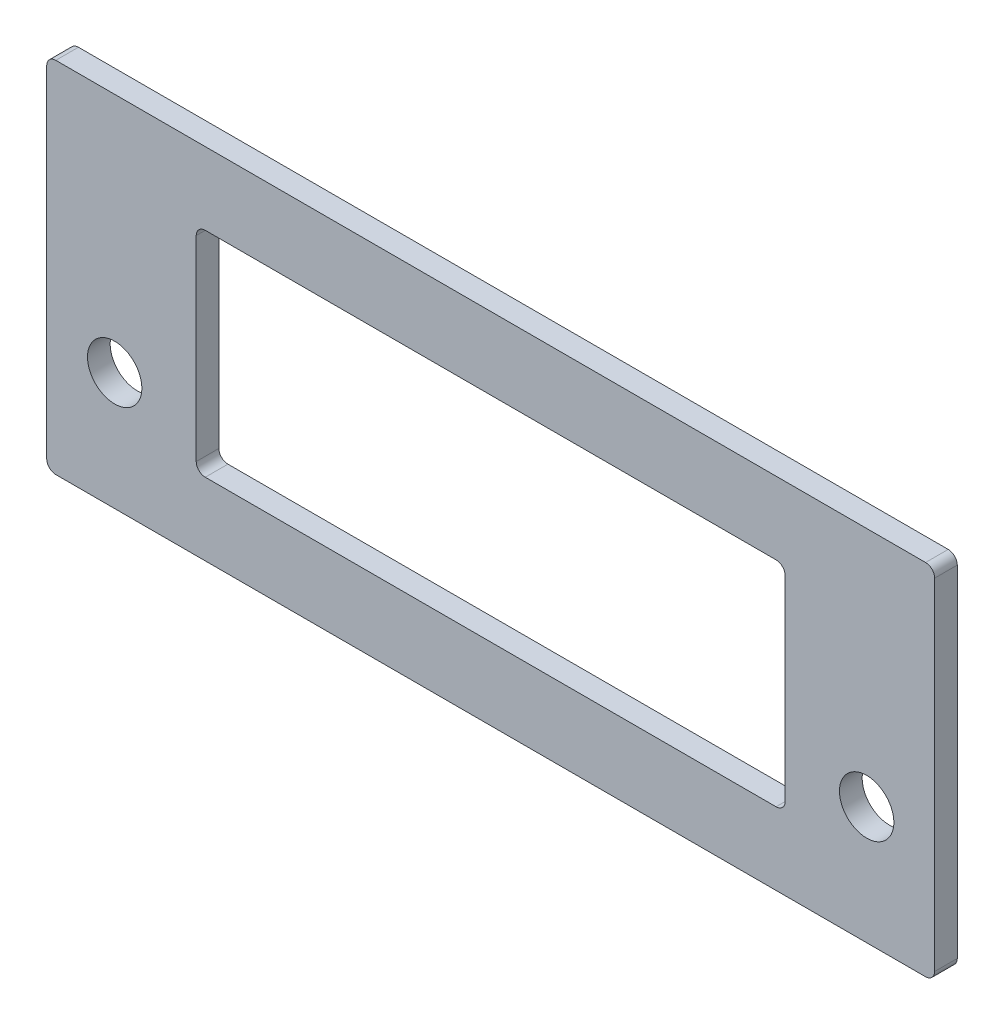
ISO-10303-21;
HEADER;
FILE_DESCRIPTION(('STEP AP214'),'2;1');
FILE_NAME('part.step','',(''),(''),'','','');
FILE_SCHEMA(('AUTOMOTIVE_DESIGN { 1 0 10303 214 1 1 1 1 }'));
ENDSEC;
DATA;
#1=APPLICATION_CONTEXT('core data for automotive mechanical design processes');
#2=APPLICATION_PROTOCOL_DEFINITION('international standard','automotive_design',2000,#1);
#3=PRODUCT_CONTEXT('',#1,'mechanical');
#4=PRODUCT('Part','Part','',(#3));
#5=PRODUCT_RELATED_PRODUCT_CATEGORY('part','',(#4));
#6=PRODUCT_DEFINITION_FORMATION('','',#4);
#7=PRODUCT_DEFINITION_CONTEXT('part definition',#1,'design');
#8=PRODUCT_DEFINITION('design','',#6,#7);
#9=PRODUCT_DEFINITION_SHAPE('','',#8);
#10=(LENGTH_UNIT() NAMED_UNIT(*) SI_UNIT(.MILLI.,.METRE.));
#11=(NAMED_UNIT(*) PLANE_ANGLE_UNIT() SI_UNIT($,.RADIAN.));
#12=(NAMED_UNIT(*) SI_UNIT($,.STERADIAN.) SOLID_ANGLE_UNIT());
#13=UNCERTAINTY_MEASURE_WITH_UNIT(LENGTH_MEASURE(1.E-05),#10,'distance_accuracy_value','');
#14=(GEOMETRIC_REPRESENTATION_CONTEXT(3) GLOBAL_UNCERTAINTY_ASSIGNED_CONTEXT((#13)) GLOBAL_UNIT_ASSIGNED_CONTEXT((#10,
#11,#12)) REPRESENTATION_CONTEXT('',''));
#15=CARTESIAN_POINT('',(0.,0.,0.));
#16=DIRECTION('',(0.,0.,1.));
#17=DIRECTION('',(1.,0.,0.));
#18=AXIS2_PLACEMENT_3D('',#15,#16,#17);
#19=CARTESIAN_POINT('',(48.,38.6,0.));
#20=DIRECTION('',(0.,0.,-1.));
#21=DIRECTION('',(-1.,0.,0.));
#22=AXIS2_PLACEMENT_3D('',#19,#20,#21);
#23=CYLINDRICAL_SURFACE('',#22,1.);
#24=CARTESIAN_POINT('',(48.,38.6,0.));
#25=DIRECTION('',(0.,0.,1.));
#26=DIRECTION('',(-1.,0.,0.));
#27=AXIS2_PLACEMENT_3D('',#24,#25,#26);
#28=CIRCLE('',#27,1.);
#29=CARTESIAN_POINT('',(49.,38.6,0.));
#30=VERTEX_POINT('',#29);
#31=CARTESIAN_POINT('',(48.,39.6,0.));
#32=VERTEX_POINT('',#31);
#33=EDGE_CURVE('E216',#30,#32,#28,.T.);
#34=ORIENTED_EDGE('',*,*,#33,.F.);
#35=DIRECTION('',(0.,0.,1.));
#36=VECTOR('',#35,1.);
#37=CARTESIAN_POINT('',(49.,38.6,0.));
#38=LINE('',#37,#36);
#39=CARTESIAN_POINT('',(49.,38.6,-2.5));
#40=VERTEX_POINT('',#39);
#41=EDGE_CURVE('E253',#40,#30,#38,.T.);
#42=ORIENTED_EDGE('',*,*,#41,.F.);
#43=CARTESIAN_POINT('',(48.,38.6,-2.5));
#44=DIRECTION('',(0.,0.,-1.));
#45=DIRECTION('',(-1.,0.,0.));
#46=AXIS2_PLACEMENT_3D('',#43,#44,#45);
#47=CIRCLE('',#46,1.);
#48=CARTESIAN_POINT('',(48.,39.6,-2.5));
#49=VERTEX_POINT('',#48);
#50=EDGE_CURVE('E298',#49,#40,#47,.T.);
#51=ORIENTED_EDGE('',*,*,#50,.F.);
#52=DIRECTION('',(0.,0.,-1.));
#53=VECTOR('',#52,1.);
#54=CARTESIAN_POINT('',(48.,39.6,0.));
#55=LINE('',#54,#53);
#56=EDGE_CURVE('E252',#32,#49,#55,.T.);
#57=ORIENTED_EDGE('',*,*,#56,.F.);
#58=EDGE_LOOP('',(#34,#42,#51,#57));
#59=FACE_BOUND('',#58,.T.);
#60=ADVANCED_FACE('F15',(#59),#23,.T.);
#61=CARTESIAN_POINT('',(48.,1.,0.));
#62=DIRECTION('',(0.,0.,-1.));
#63=DIRECTION('',(-1.,0.,0.));
#64=AXIS2_PLACEMENT_3D('',#61,#62,#63);
#65=CYLINDRICAL_SURFACE('',#64,1.);
#66=CARTESIAN_POINT('',(48.,1.,0.));
#67=DIRECTION('',(0.,0.,1.));
#68=DIRECTION('',(-1.,0.,0.));
#69=AXIS2_PLACEMENT_3D('',#66,#67,#68);
#70=CIRCLE('',#69,1.);
#71=CARTESIAN_POINT('',(48.,0.,0.));
#72=VERTEX_POINT('',#71);
#73=CARTESIAN_POINT('',(49.,1.,0.));
#74=VERTEX_POINT('',#73);
#75=EDGE_CURVE('E205',#72,#74,#70,.T.);
#76=ORIENTED_EDGE('',*,*,#75,.F.);
#77=DIRECTION('',(0.,0.,1.));
#78=VECTOR('',#77,1.);
#79=CARTESIAN_POINT('',(48.,0.,0.));
#80=LINE('',#79,#78);
#81=CARTESIAN_POINT('',(48.,0.,-2.5));
#82=VERTEX_POINT('',#81);
#83=EDGE_CURVE('E342',#82,#72,#80,.T.);
#84=ORIENTED_EDGE('',*,*,#83,.F.);
#85=CARTESIAN_POINT('',(48.,1.,-2.5));
#86=DIRECTION('',(0.,0.,-1.));
#87=DIRECTION('',(-1.,0.,0.));
#88=AXIS2_PLACEMENT_3D('',#85,#86,#87);
#89=CIRCLE('',#88,1.);
#90=CARTESIAN_POINT('',(49.,1.,-2.5));
#91=VERTEX_POINT('',#90);
#92=EDGE_CURVE('E306',#91,#82,#89,.T.);
#93=ORIENTED_EDGE('',*,*,#92,.F.);
#94=DIRECTION('',(0.,0.,-1.));
#95=VECTOR('',#94,1.);
#96=CARTESIAN_POINT('',(49.,1.,0.));
#97=LINE('',#96,#95);
#98=EDGE_CURVE('E346',#74,#91,#97,.T.);
#99=ORIENTED_EDGE('',*,*,#98,.F.);
#100=EDGE_LOOP('',(#76,#84,#93,#99));
#101=FACE_BOUND('',#100,.T.);
#102=ADVANCED_FACE('F414',(#101),#65,.T.);
#103=CARTESIAN_POINT('',(-48.,1.,0.));
#104=DIRECTION('',(0.,0.,-1.));
#105=DIRECTION('',(-1.,0.,0.));
#106=AXIS2_PLACEMENT_3D('',#103,#104,#105);
#107=CYLINDRICAL_SURFACE('',#106,1.);
#108=CARTESIAN_POINT('',(-48.,1.,0.));
#109=DIRECTION('',(0.,0.,1.));
#110=DIRECTION('',(-1.,0.,0.));
#111=AXIS2_PLACEMENT_3D('',#108,#109,#110);
#112=CIRCLE('',#111,1.);
#113=CARTESIAN_POINT('',(-49.,1.,0.));
#114=VERTEX_POINT('',#113);
#115=CARTESIAN_POINT('',(-48.,0.,0.));
#116=VERTEX_POINT('',#115);
#117=EDGE_CURVE('E220',#114,#116,#112,.T.);
#118=ORIENTED_EDGE('',*,*,#117,.F.);
#119=DIRECTION('',(0.,0.,1.));
#120=VECTOR('',#119,1.);
#121=CARTESIAN_POINT('',(-49.,1.,0.));
#122=LINE('',#121,#120);
#123=CARTESIAN_POINT('',(-49.,1.,-2.5));
#124=VERTEX_POINT('',#123);
#125=EDGE_CURVE('E336',#124,#114,#122,.T.);
#126=ORIENTED_EDGE('',*,*,#125,.F.);
#127=CARTESIAN_POINT('',(-48.,1.,-2.5));
#128=DIRECTION('',(0.,0.,-1.));
#129=DIRECTION('',(-1.,0.,0.));
#130=AXIS2_PLACEMENT_3D('',#127,#128,#129);
#131=CIRCLE('',#130,1.);
#132=CARTESIAN_POINT('',(-48.,0.,-2.5));
#133=VERTEX_POINT('',#132);
#134=EDGE_CURVE('E314',#133,#124,#131,.T.);
#135=ORIENTED_EDGE('',*,*,#134,.F.);
#136=DIRECTION('',(0.,0.,-1.));
#137=VECTOR('',#136,1.);
#138=CARTESIAN_POINT('',(-48.,0.,0.));
#139=LINE('',#138,#137);
#140=EDGE_CURVE('E339',#116,#133,#139,.T.);
#141=ORIENTED_EDGE('',*,*,#140,.F.);
#142=EDGE_LOOP('',(#118,#126,#135,#141));
#143=FACE_BOUND('',#142,.T.);
#144=ADVANCED_FACE('F430',(#143),#107,.T.);
#145=CARTESIAN_POINT('',(-48.,38.6,0.));
#146=DIRECTION('',(0.,0.,-1.));
#147=DIRECTION('',(-1.,0.,0.));
#148=AXIS2_PLACEMENT_3D('',#145,#146,#147);
#149=CYLINDRICAL_SURFACE('',#148,1.);
#150=CARTESIAN_POINT('',(-48.,38.6,0.));
#151=DIRECTION('',(0.,0.,1.));
#152=DIRECTION('',(-1.,0.,0.));
#153=AXIS2_PLACEMENT_3D('',#150,#151,#152);
#154=CIRCLE('',#153,1.);
#155=CARTESIAN_POINT('',(-48.,39.6,0.));
#156=VERTEX_POINT('',#155);
#157=CARTESIAN_POINT('',(-49.,38.6,0.));
#158=VERTEX_POINT('',#157);
#159=EDGE_CURVE('E207',#156,#158,#154,.T.);
#160=ORIENTED_EDGE('',*,*,#159,.F.);
#161=DIRECTION('',(0.,0.,1.));
#162=VECTOR('',#161,1.);
#163=CARTESIAN_POINT('',(-48.,39.6,0.));
#164=LINE('',#163,#162);
#165=CARTESIAN_POINT('',(-48.,39.6,-2.5));
#166=VERTEX_POINT('',#165);
#167=EDGE_CURVE('E248',#166,#156,#164,.T.);
#168=ORIENTED_EDGE('',*,*,#167,.F.);
#169=CARTESIAN_POINT('',(-48.,38.6,-2.5));
#170=DIRECTION('',(0.,0.,-1.));
#171=DIRECTION('',(-1.,0.,0.));
#172=AXIS2_PLACEMENT_3D('',#169,#170,#171);
#173=CIRCLE('',#172,1.);
#174=CARTESIAN_POINT('',(-49.,38.6,-2.5));
#175=VERTEX_POINT('',#174);
#176=EDGE_CURVE('E288',#175,#166,#173,.T.);
#177=ORIENTED_EDGE('',*,*,#176,.F.);
#178=DIRECTION('',(0.,0.,-1.));
#179=VECTOR('',#178,1.);
#180=CARTESIAN_POINT('',(-49.,38.6,0.));
#181=LINE('',#180,#179);
#182=EDGE_CURVE('E333',#158,#175,#181,.T.);
#183=ORIENTED_EDGE('',*,*,#182,.F.);
#184=EDGE_LOOP('',(#160,#168,#177,#183));
#185=FACE_BOUND('',#184,.T.);
#186=ADVANCED_FACE('F423',(#185),#149,.T.);
#187=CARTESIAN_POINT('',(-31.5,9.,69.1517172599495));
#188=DIRECTION('',(0.,0.,1.));
#189=DIRECTION('',(1.,0.,0.));
#190=AXIS2_PLACEMENT_3D('',#187,#188,#189);
#191=CYLINDRICAL_SURFACE('',#190,1.);
#192=CARTESIAN_POINT('',(-31.5,9.,0.));
#193=DIRECTION('',(0.,0.,-1.));
#194=DIRECTION('',(-1.,0.,0.));
#195=AXIS2_PLACEMENT_3D('',#192,#193,#194);
#196=CIRCLE('',#195,1.);
#197=CARTESIAN_POINT('',(-31.5,8.,0.));
#198=VERTEX_POINT('',#197);
#199=CARTESIAN_POINT('',(-32.5,9.,0.));
#200=VERTEX_POINT('',#199);
#201=EDGE_CURVE('E267',#198,#200,#196,.T.);
#202=ORIENTED_EDGE('',*,*,#201,.F.);
#203=DIRECTION('',(0.,0.,1.));
#204=VECTOR('',#203,1.);
#205=CARTESIAN_POINT('',(-31.5,8.,0.));
#206=LINE('',#205,#204);
#207=CARTESIAN_POINT('',(-31.5,8.,-2.5));
#208=VERTEX_POINT('',#207);
#209=EDGE_CURVE('E281',#208,#198,#206,.T.);
#210=ORIENTED_EDGE('',*,*,#209,.F.);
#211=CARTESIAN_POINT('',(-31.5,9.,-2.5));
#212=DIRECTION('',(0.,0.,1.));
#213=DIRECTION('',(-1.,0.,0.));
#214=AXIS2_PLACEMENT_3D('',#211,#212,#213);
#215=CIRCLE('',#214,1.);
#216=CARTESIAN_POINT('',(-32.5,9.,-2.5));
#217=VERTEX_POINT('',#216);
#218=EDGE_CURVE('E227',#217,#208,#215,.T.);
#219=ORIENTED_EDGE('',*,*,#218,.F.);
#220=DIRECTION('',(0.,0.,-1.));
#221=VECTOR('',#220,1.);
#222=CARTESIAN_POINT('',(-32.5,9.,-2.5));
#223=LINE('',#222,#221);
#224=EDGE_CURVE('E10',#200,#217,#223,.T.);
#225=ORIENTED_EDGE('',*,*,#224,.F.);
#226=EDGE_LOOP('',(#202,#210,#219,#225));
#227=FACE_BOUND('',#226,.T.);
#228=ADVANCED_FACE('F367',(#227),#191,.F.);
#229=CARTESIAN_POINT('',(-31.5,30.6,69.1517172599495));
#230=DIRECTION('',(0.,0.,1.));
#231=DIRECTION('',(1.,0.,0.));
#232=AXIS2_PLACEMENT_3D('',#229,#230,#231);
#233=CYLINDRICAL_SURFACE('',#232,1.);
#234=CARTESIAN_POINT('',(-31.5,30.6,0.));
#235=DIRECTION('',(0.,0.,-1.));
#236=DIRECTION('',(-1.,0.,0.));
#237=AXIS2_PLACEMENT_3D('',#234,#235,#236);
#238=CIRCLE('',#237,1.);
#239=CARTESIAN_POINT('',(-32.5,30.6,0.));
#240=VERTEX_POINT('',#239);
#241=CARTESIAN_POINT('',(-31.5,31.6,0.));
#242=VERTEX_POINT('',#241);
#243=EDGE_CURVE('E235',#240,#242,#238,.T.);
#244=ORIENTED_EDGE('',*,*,#243,.F.);
#245=DIRECTION('',(0.,0.,1.));
#246=VECTOR('',#245,1.);
#247=CARTESIAN_POINT('',(-32.5,30.6,0.));
#248=LINE('',#247,#246);
#249=CARTESIAN_POINT('',(-32.5,30.6,-2.5));
#250=VERTEX_POINT('',#249);
#251=EDGE_CURVE('E23',#250,#240,#248,.T.);
#252=ORIENTED_EDGE('',*,*,#251,.F.);
#253=CARTESIAN_POINT('',(-31.5,30.6,-2.5));
#254=DIRECTION('',(0.,0.,1.));
#255=DIRECTION('',(-1.,0.,0.));
#256=AXIS2_PLACEMENT_3D('',#253,#254,#255);
#257=CIRCLE('',#256,1.);
#258=CARTESIAN_POINT('',(-31.5,31.6,-2.5));
#259=VERTEX_POINT('',#258);
#260=EDGE_CURVE('E182',#259,#250,#257,.T.);
#261=ORIENTED_EDGE('',*,*,#260,.F.);
#262=DIRECTION('',(0.,0.,-1.));
#263=VECTOR('',#262,1.);
#264=CARTESIAN_POINT('',(-31.5,31.6,-2.5));
#265=LINE('',#264,#263);
#266=EDGE_CURVE('E166',#242,#259,#265,.T.);
#267=ORIENTED_EDGE('',*,*,#266,.F.);
#268=EDGE_LOOP('',(#244,#252,#261,#267));
#269=FACE_BOUND('',#268,.T.);
#270=ADVANCED_FACE('F183',(#269),#233,.F.);
#271=CARTESIAN_POINT('',(31.5,30.6,69.1517172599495));
#272=DIRECTION('',(0.,0.,1.));
#273=DIRECTION('',(1.,0.,0.));
#274=AXIS2_PLACEMENT_3D('',#271,#272,#273);
#275=CYLINDRICAL_SURFACE('',#274,1.);
#276=CARTESIAN_POINT('',(31.5,30.6,0.));
#277=DIRECTION('',(0.,0.,-1.));
#278=DIRECTION('',(-1.,0.,0.));
#279=AXIS2_PLACEMENT_3D('',#276,#277,#278);
#280=CIRCLE('',#279,1.);
#281=CARTESIAN_POINT('',(31.5,31.6,0.));
#282=VERTEX_POINT('',#281);
#283=CARTESIAN_POINT('',(32.5,30.6,0.));
#284=VERTEX_POINT('',#283);
#285=EDGE_CURVE('E243',#282,#284,#280,.T.);
#286=ORIENTED_EDGE('',*,*,#285,.F.);
#287=DIRECTION('',(0.,0.,1.));
#288=VECTOR('',#287,1.);
#289=CARTESIAN_POINT('',(31.5,31.6,0.));
#290=LINE('',#289,#288);
#291=CARTESIAN_POINT('',(31.5,31.6,-2.5));
#292=VERTEX_POINT('',#291);
#293=EDGE_CURVE('E179',#292,#282,#290,.T.);
#294=ORIENTED_EDGE('',*,*,#293,.F.);
#295=CARTESIAN_POINT('',(31.5,30.6,-2.5));
#296=DIRECTION('',(0.,0.,1.));
#297=DIRECTION('',(-1.,0.,0.));
#298=AXIS2_PLACEMENT_3D('',#295,#296,#297);
#299=CIRCLE('',#298,1.);
#300=CARTESIAN_POINT('',(32.5,30.6,-2.5));
#301=VERTEX_POINT('',#300);
#302=EDGE_CURVE('E194',#301,#292,#299,.T.);
#303=ORIENTED_EDGE('',*,*,#302,.F.);
#304=DIRECTION('',(0.,0.,-1.));
#305=VECTOR('',#304,1.);
#306=CARTESIAN_POINT('',(32.5,30.6,-2.5));
#307=LINE('',#306,#305);
#308=EDGE_CURVE('E274',#284,#301,#307,.T.);
#309=ORIENTED_EDGE('',*,*,#308,.F.);
#310=EDGE_LOOP('',(#286,#294,#303,#309));
#311=FACE_BOUND('',#310,.T.);
#312=ADVANCED_FACE('F376',(#311),#275,.F.);
#313=CARTESIAN_POINT('',(31.5,9.,69.1517172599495));
#314=DIRECTION('',(0.,0.,1.));
#315=DIRECTION('',(1.,0.,0.));
#316=AXIS2_PLACEMENT_3D('',#313,#314,#315);
#317=CYLINDRICAL_SURFACE('',#316,1.);
#318=CARTESIAN_POINT('',(31.5,9.,0.));
#319=DIRECTION('',(0.,0.,-1.));
#320=DIRECTION('',(-1.,0.,0.));
#321=AXIS2_PLACEMENT_3D('',#318,#319,#320);
#322=CIRCLE('',#321,1.);
#323=CARTESIAN_POINT('',(32.5,9.,0.));
#324=VERTEX_POINT('',#323);
#325=CARTESIAN_POINT('',(31.5,8.,0.));
#326=VERTEX_POINT('',#325);
#327=EDGE_CURVE('E257',#324,#326,#322,.T.);
#328=ORIENTED_EDGE('',*,*,#327,.F.);
#329=DIRECTION('',(0.,0.,1.));
#330=VECTOR('',#329,1.);
#331=CARTESIAN_POINT('',(32.5,9.,0.));
#332=LINE('',#331,#330);
#333=CARTESIAN_POINT('',(32.5,9.,-2.5));
#334=VERTEX_POINT('',#333);
#335=EDGE_CURVE('E178',#334,#324,#332,.T.);
#336=ORIENTED_EDGE('',*,*,#335,.F.);
#337=CARTESIAN_POINT('',(31.5,9.,-2.5));
#338=DIRECTION('',(0.,0.,1.));
#339=DIRECTION('',(-1.,0.,0.));
#340=AXIS2_PLACEMENT_3D('',#337,#338,#339);
#341=CIRCLE('',#340,1.);
#342=CARTESIAN_POINT('',(31.5,8.,-2.5));
#343=VERTEX_POINT('',#342);
#344=EDGE_CURVE('E324',#343,#334,#341,.T.);
#345=ORIENTED_EDGE('',*,*,#344,.F.);
#346=DIRECTION('',(0.,0.,-1.));
#347=VECTOR('',#346,1.);
#348=CARTESIAN_POINT('',(31.5,8.,-2.5));
#349=LINE('',#348,#347);
#350=EDGE_CURVE('E284',#326,#343,#349,.T.);
#351=ORIENTED_EDGE('',*,*,#350,.F.);
#352=EDGE_LOOP('',(#328,#336,#345,#351));
#353=FACE_BOUND('',#352,.T.);
#354=ADVANCED_FACE('F363',(#353),#317,.F.);
#355=CARTESIAN_POINT('',(41.5,13.,69.1517172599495));
#356=DIRECTION('',(0.,0.,-1.));
#357=DIRECTION('',(-1.,0.,0.));
#358=AXIS2_PLACEMENT_3D('',#355,#356,#357);
#359=CYLINDRICAL_SURFACE('',#358,3.);
#360=CARTESIAN_POINT('',(41.5,13.,0.));
#361=DIRECTION('',(0.,0.,-1.));
#362=DIRECTION('',(-1.,0.,0.));
#363=AXIS2_PLACEMENT_3D('',#360,#361,#362);
#364=CIRCLE('',#363,3.);
#365=CARTESIAN_POINT('',(38.5,13.,0.));
#366=VERTEX_POINT('',#365);
#367=EDGE_CURVE('E277',#366,#366,#364,.T.);
#368=ORIENTED_EDGE('',*,*,#367,.F.);
#369=EDGE_LOOP('',(#368));
#370=FACE_BOUND('',#369,.T.);
#371=CARTESIAN_POINT('',(41.5,13.,-2.5));
#372=DIRECTION('',(0.,0.,1.));
#373=DIRECTION('',(1.,0.,0.));
#374=AXIS2_PLACEMENT_3D('',#371,#372,#373);
#375=CIRCLE('',#374,3.);
#376=CARTESIAN_POINT('',(44.5,13.,-2.5));
#377=VERTEX_POINT('',#376);
#378=EDGE_CURVE('E32',#377,#377,#375,.T.);
#379=ORIENTED_EDGE('',*,*,#378,.F.);
#380=EDGE_LOOP('',(#379));
#381=FACE_BOUND('',#380,.T.);
#382=ADVANCED_FACE('F460',(#370,#381),#359,.F.);
#383=CARTESIAN_POINT('',(-41.5,13.,69.1517172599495));
#384=DIRECTION('',(0.,0.,-1.));
#385=DIRECTION('',(-1.,0.,0.));
#386=AXIS2_PLACEMENT_3D('',#383,#384,#385);
#387=CYLINDRICAL_SURFACE('',#386,3.);
#388=CARTESIAN_POINT('',(-41.5,13.,0.));
#389=DIRECTION('',(0.,0.,-1.));
#390=DIRECTION('',(-1.,0.,0.));
#391=AXIS2_PLACEMENT_3D('',#388,#389,#390);
#392=CIRCLE('',#391,3.);
#393=CARTESIAN_POINT('',(-44.5,13.,0.));
#394=VERTEX_POINT('',#393);
#395=EDGE_CURVE('E271',#394,#394,#392,.T.);
#396=ORIENTED_EDGE('',*,*,#395,.F.);
#397=EDGE_LOOP('',(#396));
#398=FACE_BOUND('',#397,.T.);
#399=CARTESIAN_POINT('',(-41.5,13.,-2.5));
#400=DIRECTION('',(0.,0.,1.));
#401=DIRECTION('',(1.,0.,0.));
#402=AXIS2_PLACEMENT_3D('',#399,#400,#401);
#403=CIRCLE('',#402,3.);
#404=CARTESIAN_POINT('',(-38.5,13.,-2.5));
#405=VERTEX_POINT('',#404);
#406=EDGE_CURVE('E318',#405,#405,#403,.T.);
#407=ORIENTED_EDGE('',*,*,#406,.F.);
#408=EDGE_LOOP('',(#407));
#409=FACE_BOUND('',#408,.T.);
#410=ADVANCED_FACE('F465',(#398,#409),#387,.F.);
#411=CARTESIAN_POINT('',(-32.5,8.,69.1517172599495));
#412=DIRECTION('',(1.,0.,0.));
#413=DIRECTION('',(0.,1.,0.));
#414=AXIS2_PLACEMENT_3D('',#411,#412,#413);
#415=PLANE('',#414);
#416=DIRECTION('',(0.,-1.,0.));
#417=VECTOR('',#416,1.);
#418=CARTESIAN_POINT('',(-32.5,8.,-2.5));
#419=LINE('',#418,#417);
#420=EDGE_CURVE('E187',#250,#217,#419,.T.);
#421=ORIENTED_EDGE('',*,*,#420,.F.);
#422=ORIENTED_EDGE('',*,*,#251,.T.);
#423=DIRECTION('',(0.,1.,0.));
#424=VECTOR('',#423,1.);
#425=CARTESIAN_POINT('',(-32.5,8.,0.));
#426=LINE('',#425,#424);
#427=EDGE_CURVE('E224',#200,#240,#426,.T.);
#428=ORIENTED_EDGE('',*,*,#427,.F.);
#429=ORIENTED_EDGE('',*,*,#224,.T.);
#430=EDGE_LOOP('',(#421,#422,#428,#429));
#431=FACE_BOUND('',#430,.T.);
#432=ADVANCED_FACE('F377',(#431),#415,.T.);
#433=CARTESIAN_POINT('',(-32.5,8.,69.1517172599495));
#434=DIRECTION('',(0.,1.,0.));
#435=DIRECTION('',(1.,0.,0.));
#436=AXIS2_PLACEMENT_3D('',#433,#434,#435);
#437=PLANE('',#436);
#438=DIRECTION('',(-1.,0.,0.));
#439=VECTOR('',#438,1.);
#440=CARTESIAN_POINT('',(-32.5,8.,0.));
#441=LINE('',#440,#439);
#442=EDGE_CURVE('E261',#326,#198,#441,.T.);
#443=ORIENTED_EDGE('',*,*,#442,.F.);
#444=ORIENTED_EDGE('',*,*,#350,.T.);
#445=DIRECTION('',(1.,0.,0.));
#446=VECTOR('',#445,1.);
#447=CARTESIAN_POINT('',(-32.5,8.,-2.5));
#448=LINE('',#447,#446);
#449=EDGE_CURVE('E321',#208,#343,#448,.T.);
#450=ORIENTED_EDGE('',*,*,#449,.F.);
#451=ORIENTED_EDGE('',*,*,#209,.T.);
#452=EDGE_LOOP('',(#443,#444,#450,#451));
#453=FACE_BOUND('',#452,.T.);
#454=ADVANCED_FACE('F360',(#453),#437,.T.);
#455=CARTESIAN_POINT('',(32.5,8.,69.1517172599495));
#456=DIRECTION('',(-1.,0.,0.));
#457=DIRECTION('',(0.,0.,1.));
#458=AXIS2_PLACEMENT_3D('',#455,#456,#457);
#459=PLANE('',#458);
#460=DIRECTION('',(0.,1.,0.));
#461=VECTOR('',#460,1.);
#462=CARTESIAN_POINT('',(32.5,8.,-2.5));
#463=LINE('',#462,#461);
#464=EDGE_CURVE('E201',#334,#301,#463,.T.);
#465=ORIENTED_EDGE('',*,*,#464,.F.);
#466=ORIENTED_EDGE('',*,*,#335,.T.);
#467=DIRECTION('',(0.,-1.,0.));
#468=VECTOR('',#467,1.);
#469=CARTESIAN_POINT('',(32.5,8.,0.));
#470=LINE('',#469,#468);
#471=EDGE_CURVE('E247',#284,#324,#470,.T.);
#472=ORIENTED_EDGE('',*,*,#471,.F.);
#473=ORIENTED_EDGE('',*,*,#308,.T.);
#474=EDGE_LOOP('',(#465,#466,#472,#473));
#475=FACE_BOUND('',#474,.T.);
#476=ADVANCED_FACE('F374',(#475),#459,.T.);
#477=CARTESIAN_POINT('',(-32.5,31.6,69.1517172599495));
#478=DIRECTION('',(0.,-1.,0.));
#479=DIRECTION('',(0.,0.,-1.));
#480=AXIS2_PLACEMENT_3D('',#477,#478,#479);
#481=PLANE('',#480);
#482=DIRECTION('',(-1.,0.,0.));
#483=VECTOR('',#482,1.);
#484=CARTESIAN_POINT('',(-32.5,31.6,-2.5));
#485=LINE('',#484,#483);
#486=EDGE_CURVE('E170',#292,#259,#485,.T.);
#487=ORIENTED_EDGE('',*,*,#486,.F.);
#488=ORIENTED_EDGE('',*,*,#293,.T.);
#489=DIRECTION('',(1.,0.,0.));
#490=VECTOR('',#489,1.);
#491=CARTESIAN_POINT('',(-32.5,31.6,0.));
#492=LINE('',#491,#490);
#493=EDGE_CURVE('E173',#242,#282,#492,.T.);
#494=ORIENTED_EDGE('',*,*,#493,.F.);
#495=ORIENTED_EDGE('',*,*,#266,.T.);
#496=EDGE_LOOP('',(#487,#488,#494,#495));
#497=FACE_BOUND('',#496,.T.);
#498=ADVANCED_FACE('F168',(#497),#481,.T.);
#499=CARTESIAN_POINT('',(-49.,39.6,0.));
#500=DIRECTION('',(0.,-1.,0.));
#501=DIRECTION('',(0.,0.,-1.));
#502=AXIS2_PLACEMENT_3D('',#499,#500,#501);
#503=PLANE('',#502);
#504=DIRECTION('',(-1.,0.,0.));
#505=VECTOR('',#504,1.);
#506=CARTESIAN_POINT('',(-49.,39.6,-2.5));
#507=LINE('',#506,#505);
#508=EDGE_CURVE('E294',#49,#166,#507,.T.);
#509=ORIENTED_EDGE('',*,*,#508,.T.);
#510=ORIENTED_EDGE('',*,*,#167,.T.);
#511=DIRECTION('',(-1.,0.,0.));
#512=VECTOR('',#511,1.);
#513=CARTESIAN_POINT('',(-49.,39.6,0.));
#514=LINE('',#513,#512);
#515=EDGE_CURVE('E211',#32,#156,#514,.T.);
#516=ORIENTED_EDGE('',*,*,#515,.F.);
#517=ORIENTED_EDGE('',*,*,#56,.T.);
#518=EDGE_LOOP('',(#509,#510,#516,#517));
#519=FACE_BOUND('',#518,.T.);
#520=ADVANCED_FACE('F401',(#519),#503,.F.);
#521=CARTESIAN_POINT('',(49.,0.,0.));
#522=DIRECTION('',(-1.,0.,0.));
#523=DIRECTION('',(0.,0.,1.));
#524=AXIS2_PLACEMENT_3D('',#521,#522,#523);
#525=PLANE('',#524);
#526=DIRECTION('',(0.,1.,0.));
#527=VECTOR('',#526,1.);
#528=CARTESIAN_POINT('',(49.,0.,0.));
#529=LINE('',#528,#527);
#530=EDGE_CURVE('E212',#74,#30,#529,.T.);
#531=ORIENTED_EDGE('',*,*,#530,.F.);
#532=ORIENTED_EDGE('',*,*,#98,.T.);
#533=DIRECTION('',(0.,1.,0.));
#534=VECTOR('',#533,1.);
#535=CARTESIAN_POINT('',(49.,0.,-2.5));
#536=LINE('',#535,#534);
#537=EDGE_CURVE('E302',#91,#40,#536,.T.);
#538=ORIENTED_EDGE('',*,*,#537,.T.);
#539=ORIENTED_EDGE('',*,*,#41,.T.);
#540=EDGE_LOOP('',(#531,#532,#538,#539));
#541=FACE_BOUND('',#540,.T.);
#542=ADVANCED_FACE('F418',(#541),#525,.F.);
#543=CARTESIAN_POINT('',(-49.,0.,0.));
#544=DIRECTION('',(0.,1.,0.));
#545=DIRECTION('',(1.,0.,0.));
#546=AXIS2_PLACEMENT_3D('',#543,#544,#545);
#547=PLANE('',#546);
#548=DIRECTION('',(1.,0.,0.));
#549=VECTOR('',#548,1.);
#550=CARTESIAN_POINT('',(-49.,0.,0.));
#551=LINE('',#550,#549);
#552=EDGE_CURVE('E231',#116,#72,#551,.T.);
#553=ORIENTED_EDGE('',*,*,#552,.F.);
#554=ORIENTED_EDGE('',*,*,#140,.T.);
#555=DIRECTION('',(1.,0.,0.));
#556=VECTOR('',#555,1.);
#557=CARTESIAN_POINT('',(-49.,0.,-2.5));
#558=LINE('',#557,#556);
#559=EDGE_CURVE('E310',#133,#82,#558,.T.);
#560=ORIENTED_EDGE('',*,*,#559,.T.);
#561=ORIENTED_EDGE('',*,*,#83,.T.);
#562=EDGE_LOOP('',(#553,#554,#560,#561));
#563=FACE_BOUND('',#562,.T.);
#564=ADVANCED_FACE('F433',(#563),#547,.F.);
#565=CARTESIAN_POINT('',(-49.,0.,0.));
#566=DIRECTION('',(1.,0.,0.));
#567=DIRECTION('',(0.,1.,0.));
#568=AXIS2_PLACEMENT_3D('',#565,#566,#567);
#569=PLANE('',#568);
#570=DIRECTION('',(0.,-1.,0.));
#571=VECTOR('',#570,1.);
#572=CARTESIAN_POINT('',(-49.,0.,0.));
#573=LINE('',#572,#571);
#574=EDGE_CURVE('E210',#158,#114,#573,.T.);
#575=ORIENTED_EDGE('',*,*,#574,.F.);
#576=ORIENTED_EDGE('',*,*,#182,.T.);
#577=DIRECTION('',(0.,-1.,0.));
#578=VECTOR('',#577,1.);
#579=CARTESIAN_POINT('',(-49.,0.,-2.5));
#580=LINE('',#579,#578);
#581=EDGE_CURVE('E280',#175,#124,#580,.T.);
#582=ORIENTED_EDGE('',*,*,#581,.T.);
#583=ORIENTED_EDGE('',*,*,#125,.T.);
#584=EDGE_LOOP('',(#575,#576,#582,#583));
#585=FACE_BOUND('',#584,.T.);
#586=ADVANCED_FACE('F427',(#585),#569,.F.);
#587=CARTESIAN_POINT('',(-49.,39.6,-2.5));
#588=DIRECTION('',(0.,0.,-1.));
#589=DIRECTION('',(0.,-1.,0.));
#590=AXIS2_PLACEMENT_3D('',#587,#588,#589);
#591=PLANE('',#590);
#592=ORIENTED_EDGE('',*,*,#378,.T.);
#593=EDGE_LOOP('',(#592));
#594=FACE_BOUND('',#593,.T.);
#595=ORIENTED_EDGE('',*,*,#449,.T.);
#596=ORIENTED_EDGE('',*,*,#344,.T.);
#597=ORIENTED_EDGE('',*,*,#464,.T.);
#598=ORIENTED_EDGE('',*,*,#302,.T.);
#599=ORIENTED_EDGE('',*,*,#486,.T.);
#600=ORIENTED_EDGE('',*,*,#260,.T.);
#601=ORIENTED_EDGE('',*,*,#420,.T.);
#602=ORIENTED_EDGE('',*,*,#218,.T.);
#603=EDGE_LOOP('',(#595,#596,#597,#598,#599,#600,#601,#602));
#604=FACE_BOUND('',#603,.T.);
#605=ORIENTED_EDGE('',*,*,#406,.T.);
#606=EDGE_LOOP('',(#605));
#607=FACE_BOUND('',#606,.T.);
#608=ORIENTED_EDGE('',*,*,#581,.F.);
#609=ORIENTED_EDGE('',*,*,#176,.T.);
#610=ORIENTED_EDGE('',*,*,#508,.F.);
#611=ORIENTED_EDGE('',*,*,#50,.T.);
#612=ORIENTED_EDGE('',*,*,#537,.F.);
#613=ORIENTED_EDGE('',*,*,#92,.T.);
#614=ORIENTED_EDGE('',*,*,#559,.F.);
#615=ORIENTED_EDGE('',*,*,#134,.T.);
#616=EDGE_LOOP('',(#608,#609,#610,#611,#612,#613,#614,#615));
#617=FACE_BOUND('',#616,.T.);
#618=ADVANCED_FACE('F190',(#594,#604,#607,#617),#591,.T.);
#619=CARTESIAN_POINT('',(-49.,39.6,0.));
#620=DIRECTION('',(0.,0.,-1.));
#621=DIRECTION('',(0.,-1.,0.));
#622=AXIS2_PLACEMENT_3D('',#619,#620,#621);
#623=PLANE('',#622);
#624=ORIENTED_EDGE('',*,*,#367,.T.);
#625=EDGE_LOOP('',(#624));
#626=FACE_BOUND('',#625,.T.);
#627=ORIENTED_EDGE('',*,*,#395,.T.);
#628=EDGE_LOOP('',(#627));
#629=FACE_BOUND('',#628,.T.);
#630=ORIENTED_EDGE('',*,*,#427,.T.);
#631=ORIENTED_EDGE('',*,*,#243,.T.);
#632=ORIENTED_EDGE('',*,*,#493,.T.);
#633=ORIENTED_EDGE('',*,*,#285,.T.);
#634=ORIENTED_EDGE('',*,*,#471,.T.);
#635=ORIENTED_EDGE('',*,*,#327,.T.);
#636=ORIENTED_EDGE('',*,*,#442,.T.);
#637=ORIENTED_EDGE('',*,*,#201,.T.);
#638=EDGE_LOOP('',(#630,#631,#632,#633,#634,#635,#636,#637));
#639=FACE_BOUND('',#638,.T.);
#640=ORIENTED_EDGE('',*,*,#515,.T.);
#641=ORIENTED_EDGE('',*,*,#159,.T.);
#642=ORIENTED_EDGE('',*,*,#574,.T.);
#643=ORIENTED_EDGE('',*,*,#117,.T.);
#644=ORIENTED_EDGE('',*,*,#552,.T.);
#645=ORIENTED_EDGE('',*,*,#75,.T.);
#646=ORIENTED_EDGE('',*,*,#530,.T.);
#647=ORIENTED_EDGE('',*,*,#33,.T.);
#648=EDGE_LOOP('',(#640,#641,#642,#643,#644,#645,#646,#647));
#649=FACE_BOUND('',#648,.T.);
#650=ADVANCED_FACE('F369',(#626,#629,#639,#649),#623,.F.);
#651=CLOSED_SHELL('',(#60,#102,#144,#186,#228,#270,#312,#354,#382,#410,#432,#454,#476,#498,#520,
#542,#564,#586,#618,#650));
#652=MANIFOLD_SOLID_BREP('B1',#651);
#653=ADVANCED_BREP_SHAPE_REPRESENTATION('',(#18,#652),#14);
#654=SHAPE_DEFINITION_REPRESENTATION(#9,#653);
ENDSEC;
END-ISO-10303-21;
